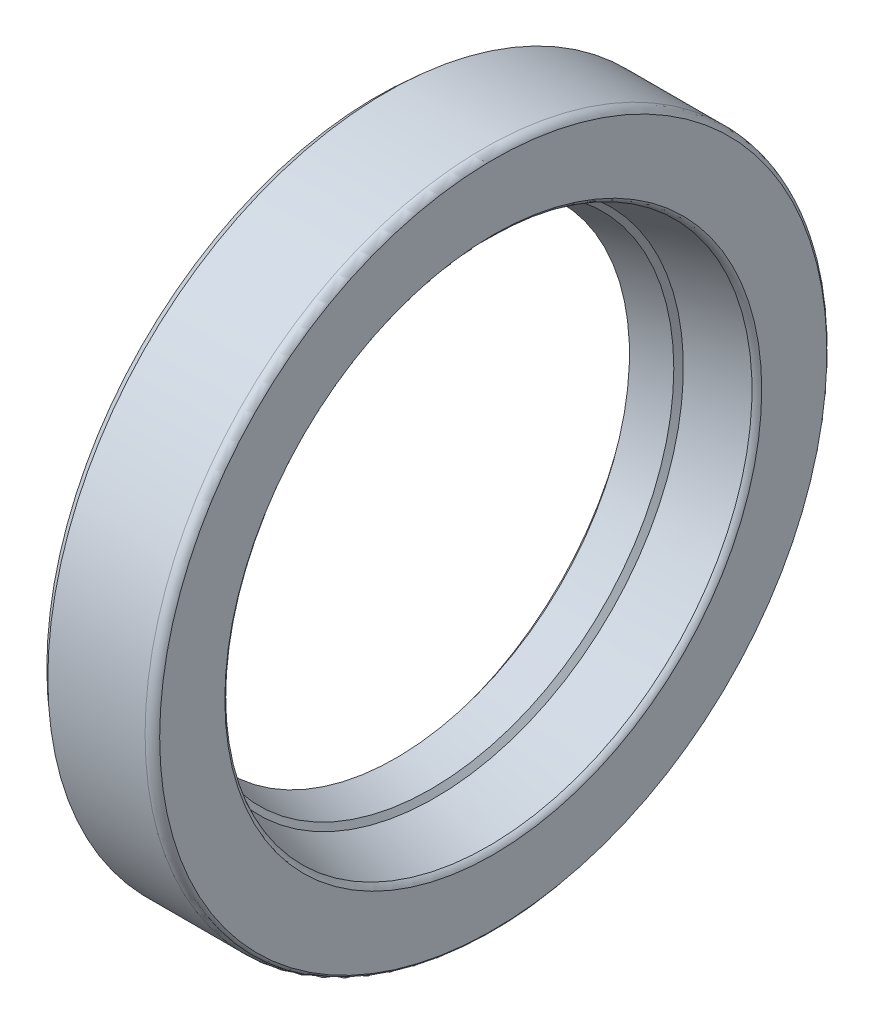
ISO-10303-21;
HEADER;
FILE_DESCRIPTION(('STEP AP214'),'2;1');
FILE_NAME('part.step','',(''),(''),'','','');
FILE_SCHEMA(('AUTOMOTIVE_DESIGN { 1 0 10303 214 1 1 1 1 }'));
ENDSEC;
DATA;
#1=APPLICATION_CONTEXT('core data for automotive mechanical design processes');
#2=APPLICATION_PROTOCOL_DEFINITION('international standard','automotive_design',2000,#1);
#3=PRODUCT_CONTEXT('',#1,'mechanical');
#4=PRODUCT('Part','Part','',(#3));
#5=PRODUCT_RELATED_PRODUCT_CATEGORY('part','',(#4));
#6=PRODUCT_DEFINITION_FORMATION('','',#4);
#7=PRODUCT_DEFINITION_CONTEXT('part definition',#1,'design');
#8=PRODUCT_DEFINITION('design','',#6,#7);
#9=PRODUCT_DEFINITION_SHAPE('','',#8);
#10=(LENGTH_UNIT() NAMED_UNIT(*) SI_UNIT(.MILLI.,.METRE.));
#11=(NAMED_UNIT(*) PLANE_ANGLE_UNIT() SI_UNIT($,.RADIAN.));
#12=(NAMED_UNIT(*) SI_UNIT($,.STERADIAN.) SOLID_ANGLE_UNIT());
#13=UNCERTAINTY_MEASURE_WITH_UNIT(LENGTH_MEASURE(1.E-05),#10,'distance_accuracy_value','');
#14=(GEOMETRIC_REPRESENTATION_CONTEXT(3) GLOBAL_UNCERTAINTY_ASSIGNED_CONTEXT((#13)) GLOBAL_UNIT_ASSIGNED_CONTEXT((#10,
#11,#12)) REPRESENTATION_CONTEXT('',''));
#15=CARTESIAN_POINT('',(0.,0.,0.));
#16=DIRECTION('',(0.,0.,1.));
#17=DIRECTION('',(1.,0.,0.));
#18=AXIS2_PLACEMENT_3D('',#15,#16,#17);
#19=CARTESIAN_POINT('',(1.66666666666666,0.,0.));
#20=DIRECTION('',(-1.,0.,0.));
#21=DIRECTION('',(0.,0.,1.));
#22=AXIS2_PLACEMENT_3D('',#19,#20,#21);
#23=CYLINDRICAL_SURFACE('',#22,29.);
#24=CARTESIAN_POINT('',(9.16666666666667,0.,0.));
#25=DIRECTION('',(-1.,0.,0.));
#26=DIRECTION('',(0.,0.,1.));
#27=AXIS2_PLACEMENT_3D('',#24,#25,#26);
#28=CIRCLE('',#27,29.);
#29=CARTESIAN_POINT('',(9.16666666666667,0.,29.));
#30=VERTEX_POINT('',#29);
#31=EDGE_CURVE('E90',#30,#30,#28,.T.);
#32=ORIENTED_EDGE('',*,*,#31,.T.);
#33=EDGE_LOOP('',(#32));
#34=FACE_BOUND('',#33,.T.);
#35=CARTESIAN_POINT('',(0.833333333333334,0.,0.));
#36=DIRECTION('',(-1.,0.,0.));
#37=DIRECTION('',(0.,0.,1.));
#38=AXIS2_PLACEMENT_3D('',#35,#36,#37);
#39=CIRCLE('',#38,29.);
#40=CARTESIAN_POINT('',(0.833333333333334,0.,29.));
#41=VERTEX_POINT('',#40);
#42=EDGE_CURVE('E9',#41,#41,#39,.T.);
#43=ORIENTED_EDGE('',*,*,#42,.F.);
#44=EDGE_LOOP('',(#43));
#45=FACE_BOUND('',#44,.T.);
#46=ADVANCED_FACE('F13',(#34,#45),#23,.T.);
#47=CARTESIAN_POINT('',(0.,0.,0.));
#48=DIRECTION('',(1.,0.,0.));
#49=DIRECTION('',(0.,0.,-1.));
#50=AXIS2_PLACEMENT_3D('',#47,#48,#49);
#51=CONICAL_SURFACE('',#50,28.25,0.732815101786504);
#52=ORIENTED_EDGE('',*,*,#42,.T.);
#53=EDGE_LOOP('',(#52));
#54=FACE_BOUND('',#53,.T.);
#55=CARTESIAN_POINT('',(0.,0.,0.));
#56=DIRECTION('',(-1.,0.,0.));
#57=DIRECTION('',(0.,0.,1.));
#58=AXIS2_PLACEMENT_3D('',#55,#56,#57);
#59=CIRCLE('',#58,28.25);
#60=CARTESIAN_POINT('',(0.,0.,28.25));
#61=VERTEX_POINT('',#60);
#62=EDGE_CURVE('E20',#61,#61,#59,.T.);
#63=ORIENTED_EDGE('',*,*,#62,.F.);
#64=EDGE_LOOP('',(#63));
#65=FACE_BOUND('',#64,.T.);
#66=ADVANCED_FACE('F117',(#54,#65),#51,.T.);
#67=CARTESIAN_POINT('',(0.,27.2,0.));
#68=DIRECTION('',(-1.,0.,0.));
#69=DIRECTION('',(0.,0.,1.));
#70=AXIS2_PLACEMENT_3D('',#67,#68,#69);
#71=PLANE('',#70);
#72=ORIENTED_EDGE('',*,*,#62,.T.);
#73=EDGE_LOOP('',(#72));
#74=FACE_BOUND('',#73,.T.);
#75=CARTESIAN_POINT('',(0.,0.,0.));
#76=DIRECTION('',(-1.,0.,0.));
#77=DIRECTION('',(0.,0.,1.));
#78=AXIS2_PLACEMENT_3D('',#75,#76,#77);
#79=CIRCLE('',#78,27.2);
#80=CARTESIAN_POINT('',(0.,0.,27.2));
#81=VERTEX_POINT('',#80);
#82=EDGE_CURVE('E29',#81,#81,#79,.T.);
#83=ORIENTED_EDGE('',*,*,#82,.F.);
#84=EDGE_LOOP('',(#83));
#85=FACE_BOUND('',#84,.T.);
#86=ADVANCED_FACE('F121',(#74,#85),#71,.T.);
#87=CARTESIAN_POINT('',(0.,0.,0.));
#88=DIRECTION('',(-1.,0.,0.));
#89=DIRECTION('',(0.,0.,1.));
#90=AXIS2_PLACEMENT_3D('',#87,#88,#89);
#91=CONICAL_SURFACE('',#90,27.2,0.0804231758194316);
#92=CARTESIAN_POINT('',(5.58333333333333,0.,0.));
#93=DIRECTION('',(-1.,0.,0.));
#94=DIRECTION('',(0.,0.,1.));
#95=AXIS2_PLACEMENT_3D('',#92,#93,#94);
#96=CIRCLE('',#95,26.75);
#97=CARTESIAN_POINT('',(5.58333333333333,0.,26.75));
#98=VERTEX_POINT('',#97);
#99=EDGE_CURVE('E36',#98,#98,#96,.T.);
#100=ORIENTED_EDGE('',*,*,#99,.F.);
#101=EDGE_LOOP('',(#100));
#102=FACE_BOUND('',#101,.T.);
#103=ORIENTED_EDGE('',*,*,#82,.T.);
#104=EDGE_LOOP('',(#103));
#105=FACE_BOUND('',#104,.T.);
#106=ADVANCED_FACE('F125',(#102,#105),#91,.F.);
#107=CARTESIAN_POINT('',(5.24046847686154,0.,0.));
#108=DIRECTION('',(-1.,0.,0.));
#109=DIRECTION('',(0.,0.,1.));
#110=AXIS2_PLACEMENT_3D('',#107,#108,#109);
#111=TOROIDAL_SURFACE('',#110,25.9904684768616,0.833333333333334);
#112=ORIENTED_EDGE('',*,*,#99,.T.);
#113=EDGE_LOOP('',(#112));
#114=FACE_BOUND('',#113,.T.);
#115=CARTESIAN_POINT('',(6.,0.,0.));
#116=DIRECTION('',(-1.,0.,0.));
#117=DIRECTION('',(0.,0.,1.));
#118=AXIS2_PLACEMENT_3D('',#115,#116,#117);
#119=CIRCLE('',#118,26.3333333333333);
#120=CARTESIAN_POINT('',(6.,0.,26.3333333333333));
#121=VERTEX_POINT('',#120);
#122=EDGE_CURVE('E42',#121,#121,#119,.T.);
#123=ORIENTED_EDGE('',*,*,#122,.F.);
#124=EDGE_LOOP('',(#123));
#125=FACE_BOUND('',#124,.T.);
#126=ADVANCED_FACE('F131',(#114,#125),#111,.F.);
#127=CARTESIAN_POINT('',(6.,26.3333333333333,0.));
#128=DIRECTION('',(1.,0.,0.));
#129=DIRECTION('',(0.,0.,-1.));
#130=AXIS2_PLACEMENT_3D('',#127,#128,#129);
#131=PLANE('',#130);
#132=CARTESIAN_POINT('',(6.,0.,0.));
#133=DIRECTION('',(-1.,0.,0.));
#134=DIRECTION('',(0.,0.,1.));
#135=AXIS2_PLACEMENT_3D('',#132,#133,#134);
#136=CIRCLE('',#135,23.);
#137=CARTESIAN_POINT('',(6.,0.,23.));
#138=VERTEX_POINT('',#137);
#139=EDGE_CURVE('E46',#138,#138,#136,.T.);
#140=ORIENTED_EDGE('',*,*,#139,.F.);
#141=EDGE_LOOP('',(#140));
#142=FACE_BOUND('',#141,.T.);
#143=ORIENTED_EDGE('',*,*,#122,.T.);
#144=EDGE_LOOP('',(#143));
#145=FACE_BOUND('',#144,.T.);
#146=ADVANCED_FACE('F135',(#142,#145),#131,.F.);
#147=CARTESIAN_POINT('',(6.,0.,0.));
#148=DIRECTION('',(1.,0.,0.));
#149=DIRECTION('',(0.,0.,-1.));
#150=AXIS2_PLACEMENT_3D('',#147,#148,#149);
#151=CONICAL_SURFACE('',#150,23.,0.211093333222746);
#152=CARTESIAN_POINT('',(3.65953102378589,0.,0.));
#153=DIRECTION('',(-1.,0.,0.));
#154=DIRECTION('',(0.,0.,1.));
#155=AXIS2_PLACEMENT_3D('',#152,#153,#154);
#156=CIRCLE('',#155,22.4984709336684);
#157=CARTESIAN_POINT('',(3.65953102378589,0.,22.4984709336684));
#158=VERTEX_POINT('',#157);
#159=EDGE_CURVE('E50',#158,#158,#156,.T.);
#160=ORIENTED_EDGE('',*,*,#159,.F.);
#161=EDGE_LOOP('',(#160));
#162=FACE_BOUND('',#161,.T.);
#163=ORIENTED_EDGE('',*,*,#139,.T.);
#164=EDGE_LOOP('',(#163));
#165=FACE_BOUND('',#164,.T.);
#166=ADVANCED_FACE('F139',(#162,#165),#151,.T.);
#167=CARTESIAN_POINT('',(2.5,0.,0.));
#168=DIRECTION('',(-1.,0.,0.));
#169=DIRECTION('',(0.,0.,1.));
#170=AXIS2_PLACEMENT_3D('',#167,#168,#169);
#171=TOROIDAL_SURFACE('',#170,22.25,1.18585412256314);
#172=CARTESIAN_POINT('',(1.98309817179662,0.,0.));
#173=DIRECTION('',(-1.,0.,0.));
#174=DIRECTION('',(0.,0.,1.));
#175=AXIS2_PLACEMENT_3D('',#172,#173,#174);
#176=CIRCLE('',#175,23.3172687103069);
#177=CARTESIAN_POINT('',(1.98309817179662,0.,23.3172687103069));
#178=VERTEX_POINT('',#177);
#179=EDGE_CURVE('E54',#178,#178,#176,.T.);
#180=ORIENTED_EDGE('',*,*,#179,.F.);
#181=EDGE_LOOP('',(#180));
#182=FACE_BOUND('',#181,.T.);
#183=ORIENTED_EDGE('',*,*,#159,.T.);
#184=EDGE_LOOP('',(#183));
#185=FACE_BOUND('',#184,.T.);
#186=ADVANCED_FACE('F143',(#182,#185),#171,.T.);
#187=CARTESIAN_POINT('',(1.66666666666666,0.,0.));
#188=DIRECTION('',(-1.,0.,0.));
#189=DIRECTION('',(0.,0.,1.));
#190=AXIS2_PLACEMENT_3D('',#187,#188,#189);
#191=CYLINDRICAL_SURFACE('',#190,23.3172687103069);
#192=ORIENTED_EDGE('',*,*,#179,.T.);
#193=EDGE_LOOP('',(#192));
#194=FACE_BOUND('',#193,.T.);
#195=CARTESIAN_POINT('',(0.666666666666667,0.,0.));
#196=DIRECTION('',(-1.,0.,0.));
#197=DIRECTION('',(0.,0.,1.));
#198=AXIS2_PLACEMENT_3D('',#195,#196,#197);
#199=CIRCLE('',#198,23.3172687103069);
#200=CARTESIAN_POINT('',(0.666666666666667,0.,23.3172687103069));
#201=VERTEX_POINT('',#200);
#202=EDGE_CURVE('E58',#201,#201,#199,.T.);
#203=ORIENTED_EDGE('',*,*,#202,.F.);
#204=EDGE_LOOP('',(#203));
#205=FACE_BOUND('',#204,.T.);
#206=ADVANCED_FACE('F147',(#194,#205),#191,.T.);
#207=CARTESIAN_POINT('',(0.666666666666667,21.2857142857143,0.));
#208=DIRECTION('',(-1.,0.,0.));
#209=DIRECTION('',(0.,0.,1.));
#210=AXIS2_PLACEMENT_3D('',#207,#208,#209);
#211=PLANE('',#210);
#212=ORIENTED_EDGE('',*,*,#202,.T.);
#213=EDGE_LOOP('',(#212));
#214=FACE_BOUND('',#213,.T.);
#215=CARTESIAN_POINT('',(0.666666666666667,0.,0.));
#216=DIRECTION('',(-1.,0.,0.));
#217=DIRECTION('',(0.,0.,1.));
#218=AXIS2_PLACEMENT_3D('',#215,#216,#217);
#219=CIRCLE('',#218,21.2857142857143);
#220=CARTESIAN_POINT('',(0.666666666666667,0.,21.2857142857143));
#221=VERTEX_POINT('',#220);
#222=EDGE_CURVE('E62',#221,#221,#219,.T.);
#223=ORIENTED_EDGE('',*,*,#222,.F.);
#224=EDGE_LOOP('',(#223));
#225=FACE_BOUND('',#224,.T.);
#226=ADVANCED_FACE('F151',(#214,#225),#211,.T.);
#227=CARTESIAN_POINT('',(1.66666666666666,0.,0.));
#228=DIRECTION('',(-1.,0.,0.));
#229=DIRECTION('',(0.,0.,1.));
#230=AXIS2_PLACEMENT_3D('',#227,#228,#229);
#231=CONICAL_SURFACE('',#230,20.,0.90975315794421);
#232=ORIENTED_EDGE('',*,*,#222,.T.);
#233=EDGE_LOOP('',(#232));
#234=FACE_BOUND('',#233,.T.);
#235=CARTESIAN_POINT('',(1.66666666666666,0.,0.));
#236=DIRECTION('',(-1.,0.,0.));
#237=DIRECTION('',(0.,0.,1.));
#238=AXIS2_PLACEMENT_3D('',#235,#236,#237);
#239=CIRCLE('',#238,20.);
#240=CARTESIAN_POINT('',(1.66666666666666,0.,20.));
#241=VERTEX_POINT('',#240);
#242=EDGE_CURVE('E66',#241,#241,#239,.T.);
#243=ORIENTED_EDGE('',*,*,#242,.F.);
#244=EDGE_LOOP('',(#243));
#245=FACE_BOUND('',#244,.T.);
#246=ADVANCED_FACE('F155',(#234,#245),#231,.F.);
#247=CARTESIAN_POINT('',(4.66666666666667,0.,0.));
#248=DIRECTION('',(1.,0.,0.));
#249=DIRECTION('',(0.,0.,-1.));
#250=AXIS2_PLACEMENT_3D('',#247,#248,#249);
#251=CONICAL_SURFACE('',#250,20.8,0.260602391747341);
#252=ORIENTED_EDGE('',*,*,#242,.T.);
#253=EDGE_LOOP('',(#252));
#254=FACE_BOUND('',#253,.T.);
#255=CARTESIAN_POINT('',(4.66666666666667,0.,0.));
#256=DIRECTION('',(-1.,0.,0.));
#257=DIRECTION('',(0.,0.,1.));
#258=AXIS2_PLACEMENT_3D('',#255,#256,#257);
#259=CIRCLE('',#258,20.8);
#260=CARTESIAN_POINT('',(4.66666666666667,0.,20.8));
#261=VERTEX_POINT('',#260);
#262=EDGE_CURVE('E70',#261,#261,#259,.T.);
#263=ORIENTED_EDGE('',*,*,#262,.F.);
#264=EDGE_LOOP('',(#263));
#265=FACE_BOUND('',#264,.T.);
#266=ADVANCED_FACE('F159',(#254,#265),#251,.F.);
#267=CARTESIAN_POINT('',(5.,0.,0.));
#268=DIRECTION('',(1.,0.,0.));
#269=DIRECTION('',(0.,0.,-1.));
#270=AXIS2_PLACEMENT_3D('',#267,#268,#269);
#271=CONICAL_SURFACE('',#270,21.2857142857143,0.969341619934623);
#272=ORIENTED_EDGE('',*,*,#262,.T.);
#273=EDGE_LOOP('',(#272));
#274=FACE_BOUND('',#273,.T.);
#275=CARTESIAN_POINT('',(5.,0.,0.));
#276=DIRECTION('',(-1.,0.,0.));
#277=DIRECTION('',(0.,0.,1.));
#278=AXIS2_PLACEMENT_3D('',#275,#276,#277);
#279=CIRCLE('',#278,21.2857142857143);
#280=CARTESIAN_POINT('',(5.,0.,21.2857142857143));
#281=VERTEX_POINT('',#280);
#282=EDGE_CURVE('E74',#281,#281,#279,.T.);
#283=ORIENTED_EDGE('',*,*,#282,.F.);
#284=EDGE_LOOP('',(#283));
#285=FACE_BOUND('',#284,.T.);
#286=ADVANCED_FACE('F163',(#274,#285),#271,.F.);
#287=CARTESIAN_POINT('',(9.58333333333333,0.,0.));
#288=DIRECTION('',(1.,0.,0.));
#289=DIRECTION('',(0.,0.,-1.));
#290=AXIS2_PLACEMENT_3D('',#287,#288,#289);
#291=CONICAL_SURFACE('',#290,22.5833333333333,0.275896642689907);
#292=ORIENTED_EDGE('',*,*,#282,.T.);
#293=EDGE_LOOP('',(#292));
#294=FACE_BOUND('',#293,.T.);
#295=CARTESIAN_POINT('',(9.58333333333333,0.,0.));
#296=DIRECTION('',(-1.,0.,0.));
#297=DIRECTION('',(0.,0.,1.));
#298=AXIS2_PLACEMENT_3D('',#295,#296,#297);
#299=CIRCLE('',#298,22.5833333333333);
#300=CARTESIAN_POINT('',(9.58333333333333,0.,22.5833333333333));
#301=VERTEX_POINT('',#300);
#302=EDGE_CURVE('E78',#301,#301,#299,.T.);
#303=ORIENTED_EDGE('',*,*,#302,.F.);
#304=EDGE_LOOP('',(#303));
#305=FACE_BOUND('',#304,.T.);
#306=ADVANCED_FACE('F113',(#294,#305),#291,.F.);
#307=CARTESIAN_POINT('',(9.24046847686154,0.,0.));
#308=DIRECTION('',(-1.,0.,0.));
#309=DIRECTION('',(0.,0.,1.));
#310=AXIS2_PLACEMENT_3D('',#307,#308,#309);
#311=TOROIDAL_SURFACE('',#310,23.3428648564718,0.833333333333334);
#312=CARTESIAN_POINT('',(10.,0.,0.));
#313=DIRECTION('',(-1.,0.,0.));
#314=DIRECTION('',(0.,0.,1.));
#315=AXIS2_PLACEMENT_3D('',#312,#313,#314);
#316=CIRCLE('',#315,23.);
#317=CARTESIAN_POINT('',(10.,0.,23.));
#318=VERTEX_POINT('',#317);
#319=EDGE_CURVE('E82',#318,#318,#316,.T.);
#320=ORIENTED_EDGE('',*,*,#319,.F.);
#321=EDGE_LOOP('',(#320));
#322=FACE_BOUND('',#321,.T.);
#323=ORIENTED_EDGE('',*,*,#302,.T.);
#324=EDGE_LOOP('',(#323));
#325=FACE_BOUND('',#324,.T.);
#326=ADVANCED_FACE('F106',(#322,#325),#311,.T.);
#327=CARTESIAN_POINT('',(10.,28.5833333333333,0.));
#328=DIRECTION('',(1.,0.,0.));
#329=DIRECTION('',(0.,0.,-1.));
#330=AXIS2_PLACEMENT_3D('',#327,#328,#329);
#331=PLANE('',#330);
#332=ORIENTED_EDGE('',*,*,#319,.T.);
#333=EDGE_LOOP('',(#332));
#334=FACE_BOUND('',#333,.T.);
#335=CARTESIAN_POINT('',(10.,0.,0.));
#336=DIRECTION('',(-1.,0.,0.));
#337=DIRECTION('',(0.,0.,1.));
#338=AXIS2_PLACEMENT_3D('',#335,#336,#337);
#339=CIRCLE('',#338,28.5833333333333);
#340=CARTESIAN_POINT('',(10.,0.,28.5833333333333));
#341=VERTEX_POINT('',#340);
#342=EDGE_CURVE('E86',#341,#341,#339,.T.);
#343=ORIENTED_EDGE('',*,*,#342,.F.);
#344=EDGE_LOOP('',(#343));
#345=FACE_BOUND('',#344,.T.);
#346=ADVANCED_FACE('F101',(#334,#345),#331,.T.);
#347=CARTESIAN_POINT('',(9.27432506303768,0.,0.));
#348=DIRECTION('',(-1.,0.,0.));
#349=DIRECTION('',(0.,0.,1.));
#350=AXIS2_PLACEMENT_3D('',#347,#348,#349);
#351=TOROIDAL_SURFACE('',#350,28.1736501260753,0.833333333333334);
#352=ORIENTED_EDGE('',*,*,#31,.F.);
#353=EDGE_LOOP('',(#352));
#354=FACE_BOUND('',#353,.T.);
#355=ORIENTED_EDGE('',*,*,#342,.T.);
#356=EDGE_LOOP('',(#355));
#357=FACE_BOUND('',#356,.T.);
#358=ADVANCED_FACE('F98',(#354,#357),#351,.T.);
#359=CLOSED_SHELL('',(#46,#66,#86,#106,#126,#146,#166,#186,#206,#226,#246,#266,#286,#306,#326,
#346,#358));
#360=MANIFOLD_SOLID_BREP('B1',#359);
#361=ADVANCED_BREP_SHAPE_REPRESENTATION('',(#18,#360),#14);
#362=SHAPE_DEFINITION_REPRESENTATION(#9,#361);
ENDSEC;
END-ISO-10303-21;
